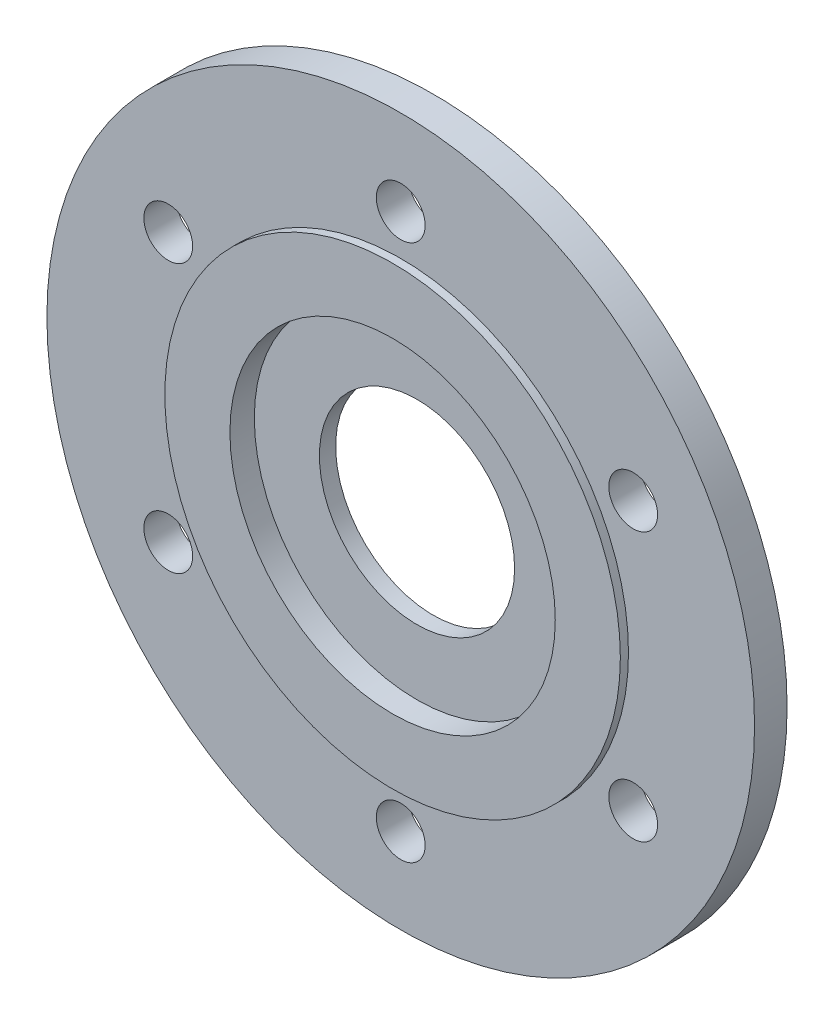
from build123d import *

# Parameters (mm, degrees)
ESQUISSE1_R                  = 43.5
EXTRUSION1_DEPTH             = 4
ESQUISSE2_R                  = 28
EXTRUSION2_DEPTH             = 1
ESQUISSE3_R                  = 20
ENL_V_MAT_EXTRU_1_DEPTH      = 3
ESQUISSE4_R                  = 12
ENL_V_MAT_EXTRU_2_DEPTH      = 62.591395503
ESQUISSE5_R                  = 3
ENL_V_MAT_EXTRU_3_DEPTH      = 62.648195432
R_P_TITION_CIRCULAIRE1_COUNT = 6


with BuildPart() as part:
    # Esquisse1 → Extrusion1 (new body)
    with BuildSketch(Plane.XY):
        Circle(ESQUISSE1_R)
    extrude(amount=EXTRUSION1_DEPTH)

    # Esquisse2 → Extrusion2 (add)
    with BuildSketch(Plane.XY.offset(4)):
        Circle(ESQUISSE2_R)
    extrude(amount=EXTRUSION2_DEPTH)

    # Esquisse3 → Enl_v. mat.-Extru.1 (cut)
    with BuildSketch(Plane.XY.offset(5)):
        Circle(ESQUISSE3_R)
    extrude(amount=-ENL_V_MAT_EXTRU_1_DEPTH, mode=Mode.SUBTRACT)

    # Esquisse4 → Enl_v. mat.-Extru.2 (cut, through all)
    with BuildSketch(Plane.XY.offset(2)):
        Circle(ESQUISSE4_R)
    extrude(amount=-ENL_V_MAT_EXTRU_2_DEPTH, mode=Mode.SUBTRACT)

    # Esquisse5 → Enl_v. mat.-Extru.3 (cut, through all)
    with BuildSketch(Plane.XY.offset(4)):
        with Locations((0, 33)):
            Circle(ESQUISSE5_R)
    enl_v_mat_extru_3 = extrude(amount=-ENL_V_MAT_EXTRU_3_DEPTH, mode=Mode.SUBTRACT)

    # R_p_tition circulaire1: Enl_v. mat.-Extru.3 ×6 about axis
    r_p_tition_circulaire1_axis = Axis((0, 0, 0), (0, 0, 1))
    for i in range(1, R_P_TITION_CIRCULAIRE1_COUNT):
        add(enl_v_mat_extru_3.rotate(r_p_tition_circulaire1_axis, i * 360 / R_P_TITION_CIRCULAIRE1_COUNT), mode=Mode.SUBTRACT)


solid = part.part
